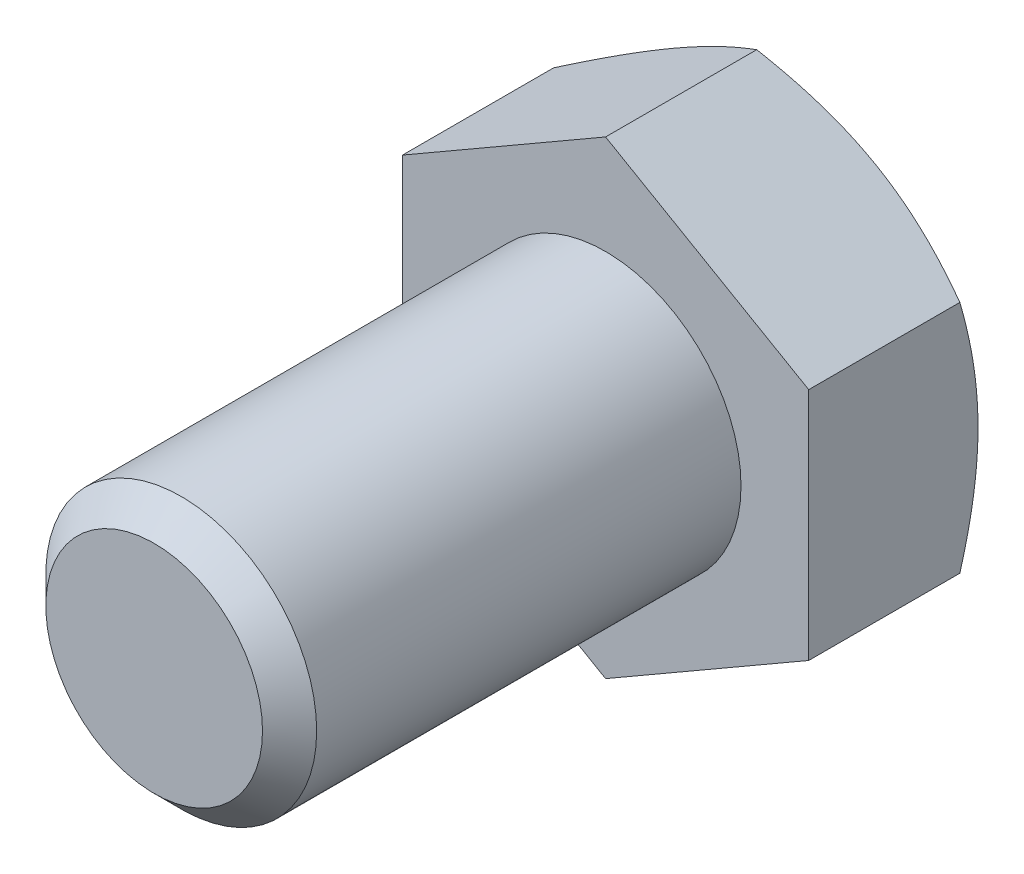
from build123d import *

# Parameters (mm, degrees)
ESQUISSE1_W        = 6
ESQUISSE1_H        = 20
CHANFREIN1_SIZE    = 1.2
BOSS_EXTRU_1_DEPTH = 7.5


with BuildPart() as part:
    # Esquisse1 → Base-R_volution (revolve)
    with BuildSketch(Plane(origin=(0, 0, 0), x_dir=(1, 0, 0), z_dir=(0, 1, 0))):
        with Locations((3, -10)):
            Rectangle(ESQUISSE1_W, ESQUISSE1_H)
    revolve(axis=Axis((0, 0, 0), (0, 0, 1)))

    # Chanfrein1
    chanfrein1_edges = [part.edges().sort_by_distance(p)[0] for p in [
        (-6, 0, 20),
    ]]
    chamfer(chanfrein1_edges, length=CHANFREIN1_SIZE)

    # Esquisse6 → Boss.-Extru.1 (add)
    with BuildSketch(Plane.XY):
        Polygon((9, -5.196152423), (9, 5.196152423), (0, 10.392304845), (-9, 5.196152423), (-9, -5.196152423), (0, -10.392304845), align=None)
    extrude(amount=-BOSS_EXTRU_1_DEPTH)

    # Esquisse7 → Enl_vement de mati_re-R_volution1 (revolve, cut)
    with BuildSketch(Plane(origin=(0, 0, 0), x_dir=(1, 0, 0), z_dir=(0, 1, 0))):
        Polygon((-9, 7.5), (-21.990381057, 7.5), (-21.990381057, 0), align=None)
    revolve(axis=Axis((0, 0, -6.239446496), (0, 0, 1)), mode=Mode.SUBTRACT)


solid = part.part
